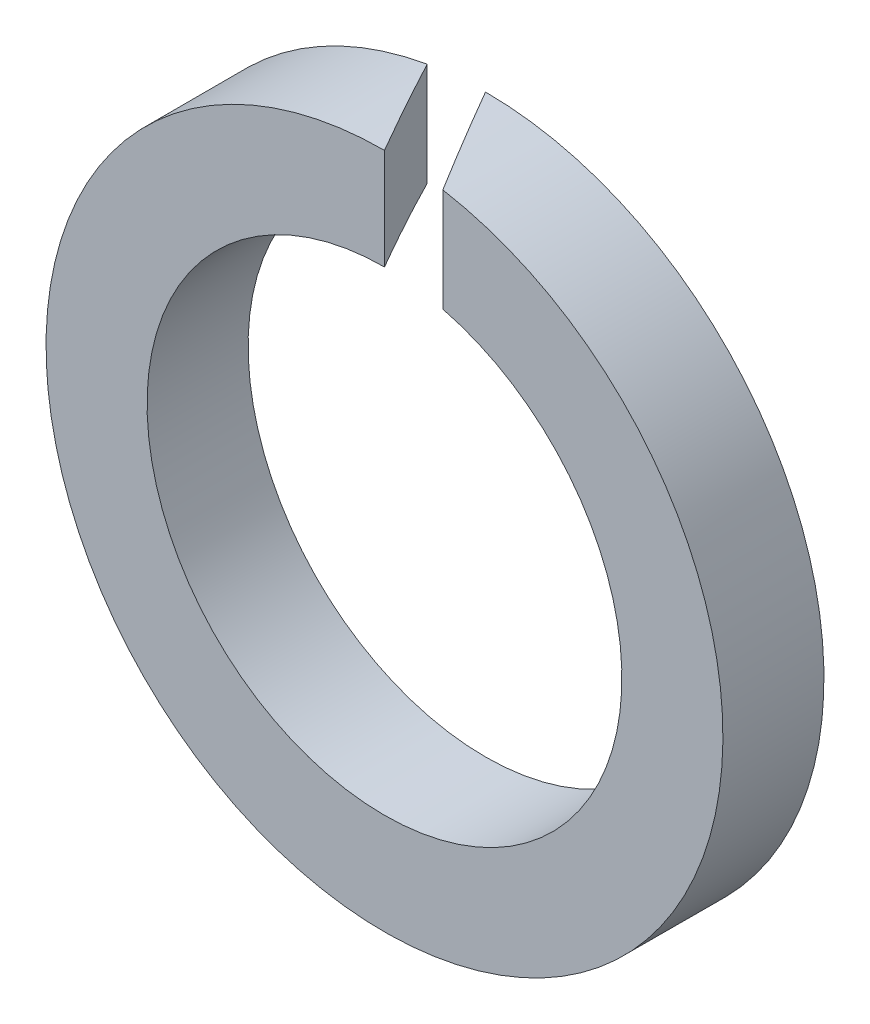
from build123d import *

# Parameters (mm, degrees)
SKETCH1_R          = 1.675
SKETCH1_R_2        = 1.175
BASE_EXTRUDE_DEPTH = 0.5
CUT_EXTRUDE1_DEPTH = 3.421001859


with BuildPart() as part:
    # Sketch1 → Base-Extrude (new body)
    with BuildSketch(Plane.XY):
        Circle(SKETCH1_R)
        Circle(SKETCH1_R_2, mode=Mode.SUBTRACT)
    extrude(amount=-BASE_EXTRUDE_DEPTH)

    # Sketch2 → Cut-Extrude1 (cut, through all)
    with BuildSketch(Plane(origin=(0, 0, 0), x_dir=(1, 0, 0), z_dir=(0, 1, 0))):
        Polygon((0, 0.5), (0.288675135, 0), (0, 0), (-0.288675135, 0.5), align=None)
    extrude(amount=CUT_EXTRUDE1_DEPTH, mode=Mode.SUBTRACT)


solid = part.part
